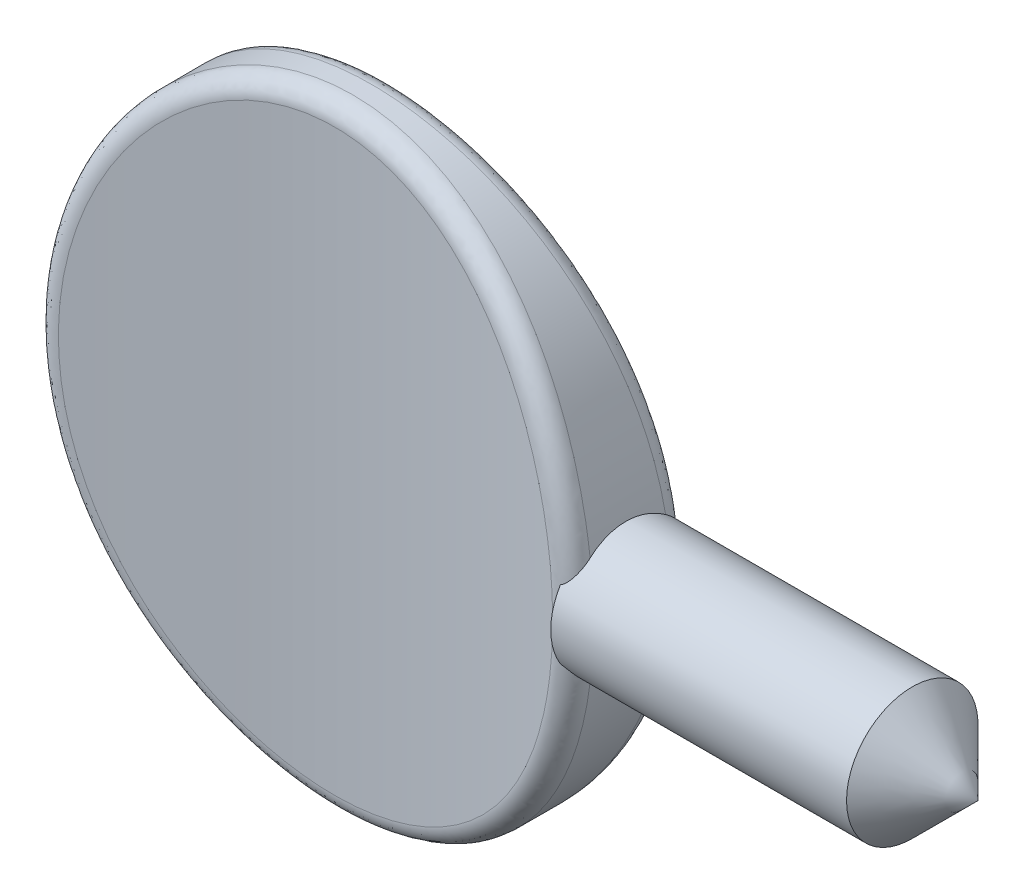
from build123d import *

# Parameters (mm, degrees)
SKETCH1_RX              = 11.303
SKETCH1_RY              = 9.906
EXTRUDE1_DEPTH          = 2.286
CUT_EXTRUDE1_DEPTH      = 16.202382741
CUT_EXTRUDE1_DEPTH_BACK = 16.202382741
SKETCH2_OUTSIDE_W       = 27.892
SKETCH2_OUTSIDE_H       = 12.652
FILLET3_R               = 0.677333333


with BuildPart() as part:
    # Sketch1 → Extrude1 (new, symmetric)
    with BuildSketch(Plane.XY):
        with Locations(Location((0, 0), (0, 0, -90))):
            Ellipse(SKETCH1_RX, SKETCH1_RY)
    extrude(amount=EXTRUDE1_DEPTH, both=True)

    # Sketch2 outside → Cut-Extrude1 (cut, two sides: drawn at the far end of the back side and taken through both)
    with BuildSketch(Plane(origin=(0, 0, 0), x_dir=(1, 0, 0), z_dir=(0, 1, 0)).offset(-CUT_EXTRUDE1_DEPTH_BACK)):
        Rectangle(SKETCH2_OUTSIDE_W, SKETCH2_OUTSIDE_H)
        with BuildLine():
            Line((-9.906, 2.286), (-9.906, -2.286))
            ThreePointArc((-9.906, -2.286), (0, -1.016), (9.906, -2.286))
            Line((9.906, -2.286), (9.906, 2.286))
            ThreePointArc((9.906, 2.286), (0, 1.016), (-9.906, 2.286))
        make_face(mode=Mode.SUBTRACT)
    extrude(amount=CUT_EXTRUDE1_DEPTH + CUT_EXTRUDE1_DEPTH_BACK, mode=Mode.SUBTRACT)

    # Fillet3
    fillet3_edges = [part.edges().sort_by_distance(p)[0] for p in [
        (-7.228513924, -7.728494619, 1.687044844),
        (3.75e-07, 11.303, -1.016),
    ]]
    fillet(fillet3_edges, radius=FILLET3_R)

    # Sketch3 → Revolve1 (revolve)
    with BuildSketch(Plane(origin=(0, 0, 0), x_dir=(1, 0, 0), z_dir=(0, 1, 0)), mode=Mode.PRIVATE) as revolve1_sk:
        with BuildLine():
            Line((20.193, 2.413), (22.606, 0))
            Line((22.606, 0), (9.072182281, 0))
            Line((9.072182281, 0), (9.072182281, 2.078343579))
            ThreePointArc((9.072182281, 2.078343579), (9.262571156, 2.199720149), (9.336678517, 2.413))
            Line((9.336678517, 2.413), (13.208, 2.413))
            Line((13.208, 2.413), (20.193, 2.413))
        make_face()
    revolve(revolve1_sk.sketch.rotate(Axis((0, 0, 0), (1, 0, 0)), 180), axis=Axis((0, 0, 0), (1, 0, 0)))


solid = part.part
